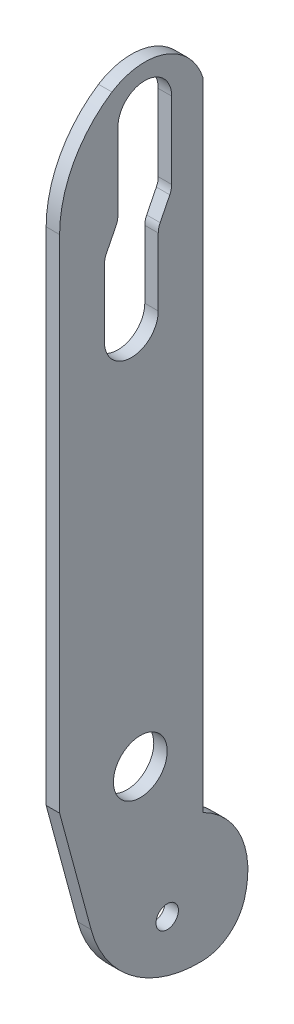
ISO-10303-21;
HEADER;
FILE_DESCRIPTION(('STEP AP214'),'2;1');
FILE_NAME('part.step','',(''),(''),'','','');
FILE_SCHEMA(('AUTOMOTIVE_DESIGN { 1 0 10303 214 1 1 1 1 }'));
ENDSEC;
DATA;
#1=APPLICATION_CONTEXT('core data for automotive mechanical design processes');
#2=APPLICATION_PROTOCOL_DEFINITION('international standard','automotive_design',2000,#1);
#3=PRODUCT_CONTEXT('',#1,'mechanical');
#4=PRODUCT('Part','Part','',(#3));
#5=PRODUCT_RELATED_PRODUCT_CATEGORY('part','',(#4));
#6=PRODUCT_DEFINITION_FORMATION('','',#4);
#7=PRODUCT_DEFINITION_CONTEXT('part definition',#1,'design');
#8=PRODUCT_DEFINITION('design','',#6,#7);
#9=PRODUCT_DEFINITION_SHAPE('','',#8);
#10=(LENGTH_UNIT() NAMED_UNIT(*) SI_UNIT(.MILLI.,.METRE.));
#11=(NAMED_UNIT(*) PLANE_ANGLE_UNIT() SI_UNIT($,.RADIAN.));
#12=(NAMED_UNIT(*) SI_UNIT($,.STERADIAN.) SOLID_ANGLE_UNIT());
#13=UNCERTAINTY_MEASURE_WITH_UNIT(LENGTH_MEASURE(1.E-05),#10,'distance_accuracy_value','');
#14=(GEOMETRIC_REPRESENTATION_CONTEXT(3) GLOBAL_UNCERTAINTY_ASSIGNED_CONTEXT((#13)) GLOBAL_UNIT_ASSIGNED_CONTEXT((#10,
#11,#12)) REPRESENTATION_CONTEXT('',''));
#15=CARTESIAN_POINT('',(0.,0.,0.));
#16=DIRECTION('',(0.,0.,1.));
#17=DIRECTION('',(1.,0.,0.));
#18=AXIS2_PLACEMENT_3D('',#15,#16,#17);
#19=CARTESIAN_POINT('',(0.75,22.0621002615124,-0.138427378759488));
#20=DIRECTION('',(1.,0.,0.));
#21=DIRECTION('',(0.,0.,-1.));
#22=AXIS2_PLACEMENT_3D('',#19,#20,#21);
#23=PLANE('',#22);
#24=CARTESIAN_POINT('',(0.75,-16.,-3.));
#25=DIRECTION('',(1.,0.,0.));
#26=DIRECTION('',(0.,0.,-1.));
#27=AXIS2_PLACEMENT_3D('',#24,#25,#26);
#28=CIRCLE('',#27,1.25);
#29=CARTESIAN_POINT('',(0.75,-16.,-4.25));
#30=VERTEX_POINT('',#29);
#31=EDGE_CURVE('E374',#30,#30,#28,.F.);
#32=ORIENTED_EDGE('',*,*,#31,.T.);
#33=EDGE_LOOP('',(#32));
#34=FACE_BOUND('',#33,.T.);
#35=CARTESIAN_POINT('',(0.75,0.,0.));
#36=DIRECTION('',(1.,0.,0.));
#37=DIRECTION('',(0.,0.,-1.));
#38=AXIS2_PLACEMENT_3D('',#35,#36,#37);
#39=CIRCLE('',#38,3.);
#40=CARTESIAN_POINT('',(0.75,0.,-3.));
#41=VERTEX_POINT('',#40);
#42=EDGE_CURVE('E376',#41,#41,#39,.F.);
#43=ORIENTED_EDGE('',*,*,#42,.T.);
#44=EDGE_LOOP('',(#43));
#45=FACE_BOUND('',#44,.T.);
#46=DIRECTION('',(0.,-0.894427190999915,0.44721359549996));
#47=VECTOR('',#46,1.);
#48=CARTESIAN_POINT('',(0.75,51.,4.00000000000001));
#49=LINE('',#48,#47);
#50=CARTESIAN_POINT('',(0.75,51.4222912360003,3.78885438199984));
#51=VERTEX_POINT('',#50);
#52=CARTESIAN_POINT('',(0.75,53.5777087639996,2.71114561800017));
#53=VERTEX_POINT('',#52);
#54=EDGE_CURVE('E301',#51,#53,#49,.F.);
#55=ORIENTED_EDGE('',*,*,#54,.T.);
#56=CARTESIAN_POINT('',(0.75,54.4721359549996,4.5));
#57=DIRECTION('',(1.,0.,0.));
#58=DIRECTION('',(0.,0.,-1.));
#59=AXIS2_PLACEMENT_3D('',#56,#57,#58);
#60=CIRCLE('',#59,2.);
#61=CARTESIAN_POINT('',(0.75,54.4721359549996,2.5));
#62=VERTEX_POINT('',#61);
#63=EDGE_CURVE('E285',#53,#62,#60,.T.);
#64=ORIENTED_EDGE('',*,*,#63,.T.);
#65=DIRECTION('',(0.,1.,0.));
#66=VECTOR('',#65,1.);
#67=CARTESIAN_POINT('',(0.75,54.,2.5));
#68=LINE('',#67,#66);
#69=CARTESIAN_POINT('',(0.75,63.,2.50000000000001));
#70=VERTEX_POINT('',#69);
#71=EDGE_CURVE('E297',#62,#70,#68,.T.);
#72=ORIENTED_EDGE('',*,*,#71,.T.);
#73=CARTESIAN_POINT('',(0.75,63.,-0.499999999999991));
#74=DIRECTION('',(1.,0.,0.));
#75=DIRECTION('',(0.,0.,-1.));
#76=AXIS2_PLACEMENT_3D('',#73,#74,#75);
#77=CIRCLE('',#76,3.);
#78=CARTESIAN_POINT('',(0.75,63.,-3.49999999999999));
#79=VERTEX_POINT('',#78);
#80=EDGE_CURVE('E324',#70,#79,#77,.F.);
#81=ORIENTED_EDGE('',*,*,#80,.T.);
#82=DIRECTION('',(0.,1.,0.));
#83=VECTOR('',#82,1.);
#84=CARTESIAN_POINT('',(0.75,63.,-3.49999999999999));
#85=LINE('',#84,#83);
#86=CARTESIAN_POINT('',(0.75,54.4721359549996,-3.49999999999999));
#87=VERTEX_POINT('',#86);
#88=EDGE_CURVE('E257',#79,#87,#85,.F.);
#89=ORIENTED_EDGE('',*,*,#88,.T.);
#90=CARTESIAN_POINT('',(0.75,54.4721359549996,-1.49999999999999));
#91=DIRECTION('',(1.,0.,0.));
#92=DIRECTION('',(0.,0.,-1.));
#93=AXIS2_PLACEMENT_3D('',#90,#91,#92);
#94=CIRCLE('',#93,2.);
#95=CARTESIAN_POINT('',(0.75,53.5777087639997,-3.28885438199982));
#96=VERTEX_POINT('',#95);
#97=EDGE_CURVE('E44',#87,#96,#94,.F.);
#98=ORIENTED_EDGE('',*,*,#97,.T.);
#99=DIRECTION('',(0.,0.894427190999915,-0.447213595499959));
#100=VECTOR('',#99,1.);
#101=CARTESIAN_POINT('',(0.75,54.,-3.49999999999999));
#102=LINE('',#101,#100);
#103=CARTESIAN_POINT('',(0.75,51.4222912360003,-2.21114561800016));
#104=VERTEX_POINT('',#103);
#105=EDGE_CURVE('E255',#96,#104,#102,.F.);
#106=ORIENTED_EDGE('',*,*,#105,.T.);
#107=CARTESIAN_POINT('',(0.75,50.5278640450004,-3.99999999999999));
#108=DIRECTION('',(1.,0.,0.));
#109=DIRECTION('',(0.,0.,-1.));
#110=AXIS2_PLACEMENT_3D('',#107,#108,#109);
#111=CIRCLE('',#110,2.);
#112=CARTESIAN_POINT('',(0.75,50.5278640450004,-1.99999999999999));
#113=VERTEX_POINT('',#112);
#114=EDGE_CURVE('E291',#104,#113,#111,.T.);
#115=ORIENTED_EDGE('',*,*,#114,.T.);
#116=DIRECTION('',(0.,1.,0.));
#117=VECTOR('',#116,1.);
#118=CARTESIAN_POINT('',(0.75,51.,-1.99999999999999));
#119=LINE('',#118,#117);
#120=CARTESIAN_POINT('',(0.75,43.,-1.99999999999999));
#121=VERTEX_POINT('',#120);
#122=EDGE_CURVE('E216',#113,#121,#119,.F.);
#123=ORIENTED_EDGE('',*,*,#122,.T.);
#124=CARTESIAN_POINT('',(0.75,43.,1.00000000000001));
#125=DIRECTION('',(1.,0.,0.));
#126=DIRECTION('',(0.,0.,-1.));
#127=AXIS2_PLACEMENT_3D('',#124,#125,#126);
#128=CIRCLE('',#127,3.);
#129=CARTESIAN_POINT('',(0.75,43.,4.00000000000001));
#130=VERTEX_POINT('',#129);
#131=EDGE_CURVE('E219',#121,#130,#128,.F.);
#132=ORIENTED_EDGE('',*,*,#131,.T.);
#133=DIRECTION('',(0.,1.,0.));
#134=VECTOR('',#133,1.);
#135=CARTESIAN_POINT('',(0.75,43.,4.00000000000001));
#136=LINE('',#135,#134);
#137=CARTESIAN_POINT('',(0.75,50.5278640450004,4.00000000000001));
#138=VERTEX_POINT('',#137);
#139=EDGE_CURVE('E314',#130,#138,#136,.T.);
#140=ORIENTED_EDGE('',*,*,#139,.T.);
#141=CARTESIAN_POINT('',(0.75,50.5278640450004,2.00000000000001));
#142=DIRECTION('',(1.,0.,0.));
#143=DIRECTION('',(0.,0.,-1.));
#144=AXIS2_PLACEMENT_3D('',#141,#142,#143);
#145=CIRCLE('',#144,2.);
#146=EDGE_CURVE('E246',#138,#51,#145,.F.);
#147=ORIENTED_EDGE('',*,*,#146,.T.);
#148=EDGE_LOOP('',(#55,#64,#72,#81,#89,#98,#106,#115,#123,#132,#140,#147));
#149=FACE_BOUND('',#148,.T.);
#150=DIRECTION('',(0.,1.,0.));
#151=VECTOR('',#150,1.);
#152=CARTESIAN_POINT('',(0.75,63.,-6.99999999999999));
#153=LINE('',#152,#151);
#154=CARTESIAN_POINT('',(0.75,63.,-6.99999999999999));
#155=VERTEX_POINT('',#154);
#156=CARTESIAN_POINT('',(0.75,-7.93774225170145,-6.99999999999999));
#157=VERTEX_POINT('',#156);
#158=EDGE_CURVE('E361',#155,#157,#153,.F.);
#159=ORIENTED_EDGE('',*,*,#158,.F.);
#160=CARTESIAN_POINT('',(0.75,61.,-0.499999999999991));
#161=DIRECTION('',(1.,0.,0.));
#162=DIRECTION('',(0.,0.,-1.));
#163=AXIS2_PLACEMENT_3D('',#160,#161,#162);
#164=CIRCLE('',#163,6.80073525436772);
#165=CARTESIAN_POINT('',(0.75,66.7306401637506,3.16193436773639));
#166=VERTEX_POINT('',#165);
#167=EDGE_CURVE('E336',#166,#155,#164,.F.);
#168=ORIENTED_EDGE('',*,*,#167,.F.);
#169=CARTESIAN_POINT('',(0.75,55.8813684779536,-3.99999999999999));
#170=DIRECTION('',(1.,0.,0.));
#171=DIRECTION('',(0.,0.,-1.));
#172=AXIS2_PLACEMENT_3D('',#169,#170,#171);
#173=CIRCLE('',#172,13.);
#174=CARTESIAN_POINT('',(0.75,55.8813684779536,9.));
#175=VERTEX_POINT('',#174);
#176=EDGE_CURVE('E332',#175,#166,#173,.F.);
#177=ORIENTED_EDGE('',*,*,#176,.F.);
#178=DIRECTION('',(0.,1.,0.));
#179=VECTOR('',#178,1.);
#180=CARTESIAN_POINT('',(0.75,0.,9.));
#181=LINE('',#180,#179);
#182=CARTESIAN_POINT('',(0.75,0.,9.));
#183=VERTEX_POINT('',#182);
#184=EDGE_CURVE('E621',#183,#175,#181,.T.);
#185=ORIENTED_EDGE('',*,*,#184,.F.);
#186=DIRECTION('',(0.,-0.965340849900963,-0.260992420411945));
#187=VECTOR('',#186,1.);
#188=CARTESIAN_POINT('',(0.75,-13.,5.48528137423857));
#189=LINE('',#188,#187);
#190=CARTESIAN_POINT('',(0.75,-13.,5.48528137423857));
#191=VERTEX_POINT('',#190);
#192=EDGE_CURVE('E179',#191,#183,#189,.F.);
#193=ORIENTED_EDGE('',*,*,#192,.F.);
#194=CARTESIAN_POINT('',(0.75,-9.73759474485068,-6.58147924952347));
#195=DIRECTION('',(1.,0.,0.));
#196=DIRECTION('',(0.,0.,-1.));
#197=AXIS2_PLACEMENT_3D('',#194,#195,#196);
#198=CIRCLE('',#197,12.5);
#199=CARTESIAN_POINT('',(0.75,-22.2320516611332,-6.95369742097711));
#200=VERTEX_POINT('',#199);
#201=EDGE_CURVE('E345',#200,#191,#198,.F.);
#202=ORIENTED_EDGE('',*,*,#201,.F.);
#203=CARTESIAN_POINT('',(0.75,-17.2342688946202,-6.80481015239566));
#204=DIRECTION('',(1.,0.,0.));
#205=DIRECTION('',(0.,0.,-1.));
#206=AXIS2_PLACEMENT_3D('',#203,#204,#205);
#207=CIRCLE('',#206,5.);
#208=CARTESIAN_POINT('',(0.75,-18.7771050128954,-11.5608228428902));
#209=VERTEX_POINT('',#208);
#210=EDGE_CURVE('E343',#209,#200,#207,.F.);
#211=ORIENTED_EDGE('',*,*,#210,.F.);
#212=CARTESIAN_POINT('',(0.75,-16.,-3.));
#213=DIRECTION('',(1.,0.,0.));
#214=DIRECTION('',(0.,0.,-1.));
#215=AXIS2_PLACEMENT_3D('',#212,#213,#214);
#216=CIRCLE('',#215,9.);
#217=EDGE_CURVE('E339',#157,#209,#216,.F.);
#218=ORIENTED_EDGE('',*,*,#217,.F.);
#219=EDGE_LOOP('',(#159,#168,#177,#185,#193,#202,#211,#218));
#220=FACE_BOUND('',#219,.T.);
#221=ADVANCED_FACE('F36',(#34,#45,#149,#220),#23,.T.);
#222=CARTESIAN_POINT('',(0.,-9.73759474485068,-6.58147924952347));
#223=DIRECTION('',(1.,0.,0.));
#224=DIRECTION('',(0.,0.,-1.));
#225=AXIS2_PLACEMENT_3D('',#222,#223,#224);
#226=CYLINDRICAL_SURFACE('',#225,12.5);
#227=CARTESIAN_POINT('',(-0.75,-9.73759474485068,-6.58147924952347));
#228=DIRECTION('',(1.,0.,0.));
#229=DIRECTION('',(0.,0.,-1.));
#230=AXIS2_PLACEMENT_3D('',#227,#228,#229);
#231=CIRCLE('',#230,12.5);
#232=CARTESIAN_POINT('',(-0.75,-13.,5.48528137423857));
#233=VERTEX_POINT('',#232);
#234=CARTESIAN_POINT('',(-0.75,-22.2320516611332,-6.95369742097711));
#235=VERTEX_POINT('',#234);
#236=EDGE_CURVE('E192',#233,#235,#231,.T.);
#237=ORIENTED_EDGE('',*,*,#236,.T.);
#238=DIRECTION('',(1.,0.,0.));
#239=VECTOR('',#238,1.);
#240=CARTESIAN_POINT('',(0.,-22.2320516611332,-6.95369742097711));
#241=LINE('',#240,#239);
#242=EDGE_CURVE('E342',#200,#235,#241,.F.);
#243=ORIENTED_EDGE('',*,*,#242,.F.);
#244=ORIENTED_EDGE('',*,*,#201,.T.);
#245=DIRECTION('',(1.,0.,0.));
#246=VECTOR('',#245,1.);
#247=CARTESIAN_POINT('',(0.,-13.,5.48528137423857));
#248=LINE('',#247,#246);
#249=EDGE_CURVE('E183',#233,#191,#248,.T.);
#250=ORIENTED_EDGE('',*,*,#249,.F.);
#251=EDGE_LOOP('',(#237,#243,#244,#250));
#252=FACE_BOUND('',#251,.T.);
#253=ADVANCED_FACE('F467',(#252),#226,.T.);
#254=CARTESIAN_POINT('',(0.,-17.2342688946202,-6.80481015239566));
#255=DIRECTION('',(1.,0.,0.));
#256=DIRECTION('',(0.,0.,-1.));
#257=AXIS2_PLACEMENT_3D('',#254,#255,#256);
#258=CYLINDRICAL_SURFACE('',#257,5.);
#259=CARTESIAN_POINT('',(-0.75,-17.2342688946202,-6.80481015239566));
#260=DIRECTION('',(1.,0.,0.));
#261=DIRECTION('',(0.,0.,-1.));
#262=AXIS2_PLACEMENT_3D('',#259,#260,#261);
#263=CIRCLE('',#262,5.);
#264=CARTESIAN_POINT('',(-0.75,-18.7771050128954,-11.5608228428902));
#265=VERTEX_POINT('',#264);
#266=EDGE_CURVE('E370',#235,#265,#263,.T.);
#267=ORIENTED_EDGE('',*,*,#266,.T.);
#268=DIRECTION('',(1.,0.,0.));
#269=VECTOR('',#268,1.);
#270=CARTESIAN_POINT('',(0.,-18.7771050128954,-11.5608228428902));
#271=LINE('',#270,#269);
#272=EDGE_CURVE('E341',#209,#265,#271,.F.);
#273=ORIENTED_EDGE('',*,*,#272,.F.);
#274=ORIENTED_EDGE('',*,*,#210,.T.);
#275=ORIENTED_EDGE('',*,*,#242,.T.);
#276=EDGE_LOOP('',(#267,#273,#274,#275));
#277=FACE_BOUND('',#276,.T.);
#278=ADVANCED_FACE('F463',(#277),#258,.T.);
#279=CARTESIAN_POINT('',(0.,-16.,-3.));
#280=DIRECTION('',(1.,0.,0.));
#281=DIRECTION('',(0.,0.,-1.));
#282=AXIS2_PLACEMENT_3D('',#279,#280,#281);
#283=CYLINDRICAL_SURFACE('',#282,9.);
#284=CARTESIAN_POINT('',(-0.75,-16.,-3.));
#285=DIRECTION('',(1.,0.,0.));
#286=DIRECTION('',(0.,0.,-1.));
#287=AXIS2_PLACEMENT_3D('',#284,#285,#286);
#288=CIRCLE('',#287,9.);
#289=CARTESIAN_POINT('',(-0.75,-7.93774225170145,-7.));
#290=VERTEX_POINT('',#289);
#291=EDGE_CURVE('E211',#265,#290,#288,.T.);
#292=ORIENTED_EDGE('',*,*,#291,.T.);
#293=DIRECTION('',(-1.,0.,0.));
#294=VECTOR('',#293,1.);
#295=CARTESIAN_POINT('',(0.,-7.93774225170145,-6.99999999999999));
#296=LINE('',#295,#294);
#297=EDGE_CURVE('E338',#157,#290,#296,.T.);
#298=ORIENTED_EDGE('',*,*,#297,.F.);
#299=ORIENTED_EDGE('',*,*,#217,.T.);
#300=ORIENTED_EDGE('',*,*,#272,.T.);
#301=EDGE_LOOP('',(#292,#298,#299,#300));
#302=FACE_BOUND('',#301,.T.);
#303=ADVANCED_FACE('F459',(#302),#283,.T.);
#304=CARTESIAN_POINT('',(0.,63.,-6.99999999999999));
#305=DIRECTION('',(0.,0.,-1.));
#306=DIRECTION('',(-1.,0.,0.));
#307=AXIS2_PLACEMENT_3D('',#304,#305,#306);
#308=PLANE('',#307);
#309=DIRECTION('',(0.,1.,0.));
#310=VECTOR('',#309,1.);
#311=CARTESIAN_POINT('',(-0.75,22.0621002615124,-7.));
#312=LINE('',#311,#310);
#313=CARTESIAN_POINT('',(-0.75,63.,-7.));
#314=VERTEX_POINT('',#313);
#315=EDGE_CURVE('E208',#290,#314,#312,.T.);
#316=ORIENTED_EDGE('',*,*,#315,.T.);
#317=DIRECTION('',(1.,0.,0.));
#318=VECTOR('',#317,1.);
#319=CARTESIAN_POINT('',(0.,63.,-6.99999999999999));
#320=LINE('',#319,#318);
#321=EDGE_CURVE('E335',#155,#314,#320,.F.);
#322=ORIENTED_EDGE('',*,*,#321,.F.);
#323=ORIENTED_EDGE('',*,*,#158,.T.);
#324=ORIENTED_EDGE('',*,*,#297,.T.);
#325=EDGE_LOOP('',(#316,#322,#323,#324));
#326=FACE_BOUND('',#325,.T.);
#327=ADVANCED_FACE('F455',(#326),#308,.T.);
#328=CARTESIAN_POINT('',(0.,61.,-0.499999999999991));
#329=DIRECTION('',(1.,0.,0.));
#330=DIRECTION('',(0.,0.,-1.));
#331=AXIS2_PLACEMENT_3D('',#328,#329,#330);
#332=CYLINDRICAL_SURFACE('',#331,6.80073525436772);
#333=CARTESIAN_POINT('',(-0.75,61.,-0.499999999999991));
#334=DIRECTION('',(1.,0.,0.));
#335=DIRECTION('',(0.,0.,-1.));
#336=AXIS2_PLACEMENT_3D('',#333,#334,#335);
#337=CIRCLE('',#336,6.80073525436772);
#338=CARTESIAN_POINT('',(-0.75,66.7306401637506,3.16193436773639));
#339=VERTEX_POINT('',#338);
#340=EDGE_CURVE('E201',#314,#339,#337,.T.);
#341=ORIENTED_EDGE('',*,*,#340,.T.);
#342=DIRECTION('',(1.,0.,0.));
#343=VECTOR('',#342,1.);
#344=CARTESIAN_POINT('',(0.,66.7306401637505,3.16193436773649));
#345=LINE('',#344,#343);
#346=EDGE_CURVE('E334',#166,#339,#345,.F.);
#347=ORIENTED_EDGE('',*,*,#346,.F.);
#348=ORIENTED_EDGE('',*,*,#167,.T.);
#349=ORIENTED_EDGE('',*,*,#321,.T.);
#350=EDGE_LOOP('',(#341,#347,#348,#349));
#351=FACE_BOUND('',#350,.T.);
#352=ADVANCED_FACE('F451',(#351),#332,.T.);
#353=CARTESIAN_POINT('',(0.,55.8813684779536,-3.99999999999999));
#354=DIRECTION('',(1.,0.,0.));
#355=DIRECTION('',(0.,0.,-1.));
#356=AXIS2_PLACEMENT_3D('',#353,#354,#355);
#357=CYLINDRICAL_SURFACE('',#356,13.);
#358=CARTESIAN_POINT('',(-0.75,55.8813684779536,-3.99999999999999));
#359=DIRECTION('',(1.,0.,0.));
#360=DIRECTION('',(0.,0.,-1.));
#361=AXIS2_PLACEMENT_3D('',#358,#359,#360);
#362=CIRCLE('',#361,13.);
#363=CARTESIAN_POINT('',(-0.75,55.8813684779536,9.));
#364=VERTEX_POINT('',#363);
#365=EDGE_CURVE('E199',#339,#364,#362,.T.);
#366=ORIENTED_EDGE('',*,*,#365,.T.);
#367=DIRECTION('',(1.,0.,0.));
#368=VECTOR('',#367,1.);
#369=CARTESIAN_POINT('',(0.,55.8813684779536,9.));
#370=LINE('',#369,#368);
#371=EDGE_CURVE('E198',#175,#364,#370,.F.);
#372=ORIENTED_EDGE('',*,*,#371,.F.);
#373=ORIENTED_EDGE('',*,*,#176,.T.);
#374=ORIENTED_EDGE('',*,*,#346,.T.);
#375=EDGE_LOOP('',(#366,#372,#373,#374));
#376=FACE_BOUND('',#375,.T.);
#377=ADVANCED_FACE('F448',(#376),#357,.T.);
#378=CARTESIAN_POINT('',(0.,0.,9.));
#379=DIRECTION('',(0.,0.,1.));
#380=DIRECTION('',(1.,0.,0.));
#381=AXIS2_PLACEMENT_3D('',#378,#379,#380);
#382=PLANE('',#381);
#383=DIRECTION('',(0.,1.,0.));
#384=VECTOR('',#383,1.);
#385=CARTESIAN_POINT('',(-0.75,22.0621002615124,9.));
#386=LINE('',#385,#384);
#387=CARTESIAN_POINT('',(-0.75,0.,9.00000000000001));
#388=VERTEX_POINT('',#387);
#389=EDGE_CURVE('E188',#364,#388,#386,.F.);
#390=ORIENTED_EDGE('',*,*,#389,.T.);
#391=DIRECTION('',(1.,0.,0.));
#392=VECTOR('',#391,1.);
#393=CARTESIAN_POINT('',(0.,0.,9.));
#394=LINE('',#393,#392);
#395=EDGE_CURVE('E173',#183,#388,#394,.F.);
#396=ORIENTED_EDGE('',*,*,#395,.F.);
#397=ORIENTED_EDGE('',*,*,#184,.T.);
#398=ORIENTED_EDGE('',*,*,#371,.T.);
#399=EDGE_LOOP('',(#390,#396,#397,#398));
#400=FACE_BOUND('',#399,.T.);
#401=ADVANCED_FACE('F196',(#400),#382,.T.);
#402=CARTESIAN_POINT('',(0.,-13.,5.48528137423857));
#403=DIRECTION('',(0.,-0.260992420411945,0.965340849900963));
#404=DIRECTION('',(0.,-0.965340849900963,-0.260992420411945));
#405=AXIS2_PLACEMENT_3D('',#402,#403,#404);
#406=PLANE('',#405);
#407=DIRECTION('',(0.,-0.965340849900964,-0.260992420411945));
#408=VECTOR('',#407,1.);
#409=CARTESIAN_POINT('',(-0.75,0.,9.));
#410=LINE('',#409,#408);
#411=EDGE_CURVE('E177',#388,#233,#410,.T.);
#412=ORIENTED_EDGE('',*,*,#411,.T.);
#413=ORIENTED_EDGE('',*,*,#249,.T.);
#414=ORIENTED_EDGE('',*,*,#192,.T.);
#415=ORIENTED_EDGE('',*,*,#395,.T.);
#416=EDGE_LOOP('',(#412,#413,#414,#415));
#417=FACE_BOUND('',#416,.T.);
#418=ADVANCED_FACE('F175',(#417),#406,.T.);
#419=CARTESIAN_POINT('',(0.,43.,4.00000000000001));
#420=DIRECTION('',(0.,0.,1.));
#421=DIRECTION('',(1.,0.,0.));
#422=AXIS2_PLACEMENT_3D('',#419,#420,#421);
#423=PLANE('',#422);
#424=DIRECTION('',(0.,1.,0.));
#425=VECTOR('',#424,1.);
#426=CARTESIAN_POINT('',(-0.75,22.0621002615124,4.00000000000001));
#427=LINE('',#426,#425);
#428=CARTESIAN_POINT('',(-0.75,43.,4.00000000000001));
#429=VERTEX_POINT('',#428);
#430=CARTESIAN_POINT('',(-0.75,50.5278640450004,4.00000000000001));
#431=VERTEX_POINT('',#430);
#432=EDGE_CURVE('E194',#429,#431,#427,.T.);
#433=ORIENTED_EDGE('',*,*,#432,.T.);
#434=DIRECTION('',(1.,0.,0.));
#435=VECTOR('',#434,1.);
#436=CARTESIAN_POINT('',(0.750000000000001,50.5278640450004,4.00000000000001));
#437=LINE('',#436,#435);
#438=EDGE_CURVE('E318',#431,#138,#437,.T.);
#439=ORIENTED_EDGE('',*,*,#438,.T.);
#440=ORIENTED_EDGE('',*,*,#139,.F.);
#441=DIRECTION('',(1.,0.,0.));
#442=VECTOR('',#441,1.);
#443=CARTESIAN_POINT('',(0.,43.,4.00000000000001));
#444=LINE('',#443,#442);
#445=EDGE_CURVE('E212',#130,#429,#444,.F.);
#446=ORIENTED_EDGE('',*,*,#445,.T.);
#447=EDGE_LOOP('',(#433,#439,#440,#446));
#448=FACE_BOUND('',#447,.T.);
#449=ADVANCED_FACE('F440',(#448),#423,.F.);
#450=CARTESIAN_POINT('',(0.,51.,4.00000000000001));
#451=DIRECTION('',(0.,0.44721359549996,0.894427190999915));
#452=DIRECTION('',(0.,-0.894427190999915,0.44721359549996));
#453=AXIS2_PLACEMENT_3D('',#450,#451,#452);
#454=PLANE('',#453);
#455=ORIENTED_EDGE('',*,*,#54,.F.);
#456=DIRECTION('',(1.,0.,0.));
#457=VECTOR('',#456,1.);
#458=CARTESIAN_POINT('',(-0.75,51.4222912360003,3.78885438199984));
#459=LINE('',#458,#457);
#460=CARTESIAN_POINT('',(-0.75,51.4222912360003,3.78885438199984));
#461=VERTEX_POINT('',#460);
#462=EDGE_CURVE('E292',#51,#461,#459,.F.);
#463=ORIENTED_EDGE('',*,*,#462,.T.);
#464=DIRECTION('',(0.,0.894427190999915,-0.44721359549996));
#465=VECTOR('',#464,1.);
#466=CARTESIAN_POINT('',(-0.75,51.,4.00000000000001));
#467=LINE('',#466,#465);
#468=CARTESIAN_POINT('',(-0.75,53.5777087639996,2.71114561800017));
#469=VERTEX_POINT('',#468);
#470=EDGE_CURVE('E284',#461,#469,#467,.T.);
#471=ORIENTED_EDGE('',*,*,#470,.T.);
#472=DIRECTION('',(1.,0.,0.));
#473=VECTOR('',#472,1.);
#474=CARTESIAN_POINT('',(0.,53.5777087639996,2.71114561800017));
#475=LINE('',#474,#473);
#476=EDGE_CURVE('E294',#469,#53,#475,.T.);
#477=ORIENTED_EDGE('',*,*,#476,.T.);
#478=EDGE_LOOP('',(#455,#463,#471,#477));
#479=FACE_BOUND('',#478,.T.);
#480=ADVANCED_FACE('F437',(#479),#454,.F.);
#481=CARTESIAN_POINT('',(0.,54.,2.5));
#482=DIRECTION('',(0.,0.,1.));
#483=DIRECTION('',(1.,0.,0.));
#484=AXIS2_PLACEMENT_3D('',#481,#482,#483);
#485=PLANE('',#484);
#486=ORIENTED_EDGE('',*,*,#71,.F.);
#487=DIRECTION('',(1.,0.,0.));
#488=VECTOR('',#487,1.);
#489=CARTESIAN_POINT('',(0.,54.4721359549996,2.5));
#490=LINE('',#489,#488);
#491=CARTESIAN_POINT('',(-0.75,54.4721359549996,2.5));
#492=VERTEX_POINT('',#491);
#493=EDGE_CURVE('E234',#62,#492,#490,.F.);
#494=ORIENTED_EDGE('',*,*,#493,.T.);
#495=DIRECTION('',(0.,1.,0.));
#496=VECTOR('',#495,1.);
#497=CARTESIAN_POINT('',(-0.75,22.0621002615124,2.5));
#498=LINE('',#497,#496);
#499=CARTESIAN_POINT('',(-0.75,63.,2.50000000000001));
#500=VERTEX_POINT('',#499);
#501=EDGE_CURVE('E273',#492,#500,#498,.T.);
#502=ORIENTED_EDGE('',*,*,#501,.T.);
#503=DIRECTION('',(1.,0.,0.));
#504=VECTOR('',#503,1.);
#505=CARTESIAN_POINT('',(0.,63.,2.50000000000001));
#506=LINE('',#505,#504);
#507=EDGE_CURVE('E300',#500,#70,#506,.T.);
#508=ORIENTED_EDGE('',*,*,#507,.T.);
#509=EDGE_LOOP('',(#486,#494,#502,#508));
#510=FACE_BOUND('',#509,.T.);
#511=ADVANCED_FACE('F434',(#510),#485,.F.);
#512=CARTESIAN_POINT('',(0.,63.,-0.499999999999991));
#513=DIRECTION('',(1.,0.,0.));
#514=DIRECTION('',(0.,0.,-1.));
#515=AXIS2_PLACEMENT_3D('',#512,#513,#514);
#516=CYLINDRICAL_SURFACE('',#515,3.);
#517=ORIENTED_EDGE('',*,*,#507,.F.);
#518=CARTESIAN_POINT('',(-0.75,63.,-0.499999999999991));
#519=DIRECTION('',(1.,0.,0.));
#520=DIRECTION('',(0.,0.,-1.));
#521=AXIS2_PLACEMENT_3D('',#518,#519,#520);
#522=CIRCLE('',#521,3.);
#523=CARTESIAN_POINT('',(-0.75,63.,-3.49999999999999));
#524=VERTEX_POINT('',#523);
#525=EDGE_CURVE('E271',#500,#524,#522,.F.);
#526=ORIENTED_EDGE('',*,*,#525,.T.);
#527=DIRECTION('',(-1.,0.,0.));
#528=VECTOR('',#527,1.);
#529=CARTESIAN_POINT('',(0.,63.,-3.49999999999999));
#530=LINE('',#529,#528);
#531=EDGE_CURVE('E222',#524,#79,#530,.F.);
#532=ORIENTED_EDGE('',*,*,#531,.T.);
#533=ORIENTED_EDGE('',*,*,#80,.F.);
#534=EDGE_LOOP('',(#517,#526,#532,#533));
#535=FACE_BOUND('',#534,.T.);
#536=ADVANCED_FACE('F431',(#535),#516,.F.);
#537=CARTESIAN_POINT('',(0.,63.,-3.49999999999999));
#538=DIRECTION('',(0.,0.,-1.));
#539=DIRECTION('',(-1.,0.,0.));
#540=AXIS2_PLACEMENT_3D('',#537,#538,#539);
#541=PLANE('',#540);
#542=DIRECTION('',(0.,1.,0.));
#543=VECTOR('',#542,1.);
#544=CARTESIAN_POINT('',(-0.75,22.0621002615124,-3.49999999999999));
#545=LINE('',#544,#543);
#546=CARTESIAN_POINT('',(-0.75,54.4721359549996,-3.49999999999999));
#547=VERTEX_POINT('',#546);
#548=EDGE_CURVE('E229',#524,#547,#545,.F.);
#549=ORIENTED_EDGE('',*,*,#548,.T.);
#550=DIRECTION('',(1.,0.,0.));
#551=VECTOR('',#550,1.);
#552=CARTESIAN_POINT('',(0.75,54.4721359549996,-3.49999999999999));
#553=LINE('',#552,#551);
#554=EDGE_CURVE('E243',#547,#87,#553,.T.);
#555=ORIENTED_EDGE('',*,*,#554,.T.);
#556=ORIENTED_EDGE('',*,*,#88,.F.);
#557=ORIENTED_EDGE('',*,*,#531,.F.);
#558=EDGE_LOOP('',(#549,#555,#556,#557));
#559=FACE_BOUND('',#558,.T.);
#560=ADVANCED_FACE('F267',(#559),#541,.F.);
#561=CARTESIAN_POINT('',(0.,54.,-3.49999999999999));
#562=DIRECTION('',(0.,-0.447213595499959,-0.894427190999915));
#563=DIRECTION('',(0.,0.894427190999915,-0.447213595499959));
#564=AXIS2_PLACEMENT_3D('',#561,#562,#563);
#565=PLANE('',#564);
#566=DIRECTION('',(0.,-0.894427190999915,0.44721359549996));
#567=VECTOR('',#566,1.);
#568=CARTESIAN_POINT('',(-0.75,54.,-3.49999999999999));
#569=LINE('',#568,#567);
#570=CARTESIAN_POINT('',(-0.75,53.5777087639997,-3.28885438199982));
#571=VERTEX_POINT('',#570);
#572=CARTESIAN_POINT('',(-0.75,51.4222912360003,-2.21114561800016));
#573=VERTEX_POINT('',#572);
#574=EDGE_CURVE('E225',#571,#573,#569,.T.);
#575=ORIENTED_EDGE('',*,*,#574,.T.);
#576=DIRECTION('',(1.,0.,0.));
#577=VECTOR('',#576,1.);
#578=CARTESIAN_POINT('',(0.,51.4222912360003,-2.21114561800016));
#579=LINE('',#578,#577);
#580=EDGE_CURVE('E238',#573,#104,#579,.T.);
#581=ORIENTED_EDGE('',*,*,#580,.T.);
#582=ORIENTED_EDGE('',*,*,#105,.F.);
#583=DIRECTION('',(1.,0.,0.));
#584=VECTOR('',#583,1.);
#585=CARTESIAN_POINT('',(-0.75,53.5777087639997,-3.28885438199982));
#586=LINE('',#585,#584);
#587=EDGE_CURVE('E236',#96,#571,#586,.F.);
#588=ORIENTED_EDGE('',*,*,#587,.T.);
#589=EDGE_LOOP('',(#575,#581,#582,#588));
#590=FACE_BOUND('',#589,.T.);
#591=ADVANCED_FACE('F262',(#590),#565,.F.);
#592=CARTESIAN_POINT('',(0.,51.,-1.99999999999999));
#593=DIRECTION('',(0.,0.,-1.));
#594=DIRECTION('',(-1.,0.,0.));
#595=AXIS2_PLACEMENT_3D('',#592,#593,#594);
#596=PLANE('',#595);
#597=ORIENTED_EDGE('',*,*,#122,.F.);
#598=DIRECTION('',(1.,0.,0.));
#599=VECTOR('',#598,1.);
#600=CARTESIAN_POINT('',(0.,50.5278640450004,-1.99999999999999));
#601=LINE('',#600,#599);
#602=CARTESIAN_POINT('',(-0.75,50.5278640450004,-1.99999999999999));
#603=VERTEX_POINT('',#602);
#604=EDGE_CURVE('E241',#113,#603,#601,.F.);
#605=ORIENTED_EDGE('',*,*,#604,.T.);
#606=DIRECTION('',(0.,1.,0.));
#607=VECTOR('',#606,1.);
#608=CARTESIAN_POINT('',(-0.75,22.0621002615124,-1.99999999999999));
#609=LINE('',#608,#607);
#610=CARTESIAN_POINT('',(-0.75,43.,-1.99999999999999));
#611=VERTEX_POINT('',#610);
#612=EDGE_CURVE('E228',#603,#611,#609,.F.);
#613=ORIENTED_EDGE('',*,*,#612,.T.);
#614=DIRECTION('',(1.,0.,0.));
#615=VECTOR('',#614,1.);
#616=CARTESIAN_POINT('',(0.,43.,-1.99999999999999));
#617=LINE('',#616,#615);
#618=EDGE_CURVE('E215',#611,#121,#617,.T.);
#619=ORIENTED_EDGE('',*,*,#618,.T.);
#620=EDGE_LOOP('',(#597,#605,#613,#619));
#621=FACE_BOUND('',#620,.T.);
#622=ADVANCED_FACE('F388',(#621),#596,.F.);
#623=CARTESIAN_POINT('',(0.,43.,1.00000000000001));
#624=DIRECTION('',(1.,0.,0.));
#625=DIRECTION('',(0.,0.,-1.));
#626=AXIS2_PLACEMENT_3D('',#623,#624,#625);
#627=CYLINDRICAL_SURFACE('',#626,3.);
#628=ORIENTED_EDGE('',*,*,#618,.F.);
#629=CARTESIAN_POINT('',(-0.75,43.,1.00000000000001));
#630=DIRECTION('',(1.,0.,0.));
#631=DIRECTION('',(0.,0.,-1.));
#632=AXIS2_PLACEMENT_3D('',#629,#630,#631);
#633=CIRCLE('',#632,3.);
#634=EDGE_CURVE('E358',#611,#429,#633,.F.);
#635=ORIENTED_EDGE('',*,*,#634,.T.);
#636=ORIENTED_EDGE('',*,*,#445,.F.);
#637=ORIENTED_EDGE('',*,*,#131,.F.);
#638=EDGE_LOOP('',(#628,#635,#636,#637));
#639=FACE_BOUND('',#638,.T.);
#640=ADVANCED_FACE('F385',(#639),#627,.F.);
#641=CARTESIAN_POINT('',(0.,0.,0.));
#642=DIRECTION('',(1.,0.,0.));
#643=DIRECTION('',(0.,0.,-1.));
#644=AXIS2_PLACEMENT_3D('',#641,#642,#643);
#645=CYLINDRICAL_SURFACE('',#644,3.);
#646=ORIENTED_EDGE('',*,*,#42,.F.);
#647=EDGE_LOOP('',(#646));
#648=FACE_BOUND('',#647,.T.);
#649=CARTESIAN_POINT('',(-0.75,0.,0.));
#650=DIRECTION('',(1.,0.,0.));
#651=DIRECTION('',(0.,0.,-1.));
#652=AXIS2_PLACEMENT_3D('',#649,#650,#651);
#653=CIRCLE('',#652,3.);
#654=CARTESIAN_POINT('',(-0.75,0.,-3.));
#655=VERTEX_POINT('',#654);
#656=EDGE_CURVE('E353',#655,#655,#653,.F.);
#657=ORIENTED_EDGE('',*,*,#656,.T.);
#658=EDGE_LOOP('',(#657));
#659=FACE_BOUND('',#658,.T.);
#660=ADVANCED_FACE('F412',(#648,#659),#645,.F.);
#661=CARTESIAN_POINT('',(0.,-16.,-3.));
#662=DIRECTION('',(1.,0.,0.));
#663=DIRECTION('',(0.,0.,-1.));
#664=AXIS2_PLACEMENT_3D('',#661,#662,#663);
#665=CYLINDRICAL_SURFACE('',#664,1.25);
#666=ORIENTED_EDGE('',*,*,#31,.F.);
#667=EDGE_LOOP('',(#666));
#668=FACE_BOUND('',#667,.T.);
#669=CARTESIAN_POINT('',(-0.75,-16.,-3.));
#670=DIRECTION('',(1.,0.,0.));
#671=DIRECTION('',(0.,0.,-1.));
#672=AXIS2_PLACEMENT_3D('',#669,#670,#671);
#673=CIRCLE('',#672,1.25);
#674=CARTESIAN_POINT('',(-0.75,-16.,-4.25));
#675=VERTEX_POINT('',#674);
#676=EDGE_CURVE('E347',#675,#675,#673,.F.);
#677=ORIENTED_EDGE('',*,*,#676,.T.);
#678=EDGE_LOOP('',(#677));
#679=FACE_BOUND('',#678,.T.);
#680=ADVANCED_FACE('F404',(#668,#679),#665,.F.);
#681=CARTESIAN_POINT('',(-0.75,22.0621002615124,-0.138427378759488));
#682=DIRECTION('',(1.,0.,0.));
#683=DIRECTION('',(0.,0.,-1.));
#684=AXIS2_PLACEMENT_3D('',#681,#682,#683);
#685=PLANE('',#684);
#686=ORIENTED_EDGE('',*,*,#676,.F.);
#687=EDGE_LOOP('',(#686));
#688=FACE_BOUND('',#687,.T.);
#689=ORIENTED_EDGE('',*,*,#656,.F.);
#690=EDGE_LOOP('',(#689));
#691=FACE_BOUND('',#690,.T.);
#692=ORIENTED_EDGE('',*,*,#501,.F.);
#693=CARTESIAN_POINT('',(-0.75,54.4721359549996,4.5));
#694=DIRECTION('',(1.,0.,0.));
#695=DIRECTION('',(0.,0.,-1.));
#696=AXIS2_PLACEMENT_3D('',#693,#694,#695);
#697=CIRCLE('',#696,2.);
#698=EDGE_CURVE('E233',#492,#469,#697,.F.);
#699=ORIENTED_EDGE('',*,*,#698,.T.);
#700=ORIENTED_EDGE('',*,*,#470,.F.);
#701=CARTESIAN_POINT('',(-0.75,50.5278640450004,2.00000000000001));
#702=DIRECTION('',(1.,0.,0.));
#703=DIRECTION('',(0.,0.,-1.));
#704=AXIS2_PLACEMENT_3D('',#701,#702,#703);
#705=CIRCLE('',#704,2.);
#706=EDGE_CURVE('E248',#461,#431,#705,.T.);
#707=ORIENTED_EDGE('',*,*,#706,.T.);
#708=ORIENTED_EDGE('',*,*,#432,.F.);
#709=ORIENTED_EDGE('',*,*,#634,.F.);
#710=ORIENTED_EDGE('',*,*,#612,.F.);
#711=CARTESIAN_POINT('',(-0.75,50.5278640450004,-3.99999999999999));
#712=DIRECTION('',(1.,0.,0.));
#713=DIRECTION('',(0.,0.,-1.));
#714=AXIS2_PLACEMENT_3D('',#711,#712,#713);
#715=CIRCLE('',#714,2.);
#716=EDGE_CURVE('E55',#603,#573,#715,.F.);
#717=ORIENTED_EDGE('',*,*,#716,.T.);
#718=ORIENTED_EDGE('',*,*,#574,.F.);
#719=CARTESIAN_POINT('',(-0.75,54.4721359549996,-1.49999999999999));
#720=DIRECTION('',(1.,0.,0.));
#721=DIRECTION('',(0.,0.,-1.));
#722=AXIS2_PLACEMENT_3D('',#719,#720,#721);
#723=CIRCLE('',#722,2.);
#724=EDGE_CURVE('E11',#571,#547,#723,.T.);
#725=ORIENTED_EDGE('',*,*,#724,.T.);
#726=ORIENTED_EDGE('',*,*,#548,.F.);
#727=ORIENTED_EDGE('',*,*,#525,.F.);
#728=EDGE_LOOP('',(#692,#699,#700,#707,#708,#709,#710,#717,#718,#725,#726,#727));
#729=FACE_BOUND('',#728,.T.);
#730=ORIENTED_EDGE('',*,*,#389,.F.);
#731=ORIENTED_EDGE('',*,*,#365,.F.);
#732=ORIENTED_EDGE('',*,*,#340,.F.);
#733=ORIENTED_EDGE('',*,*,#315,.F.);
#734=ORIENTED_EDGE('',*,*,#291,.F.);
#735=ORIENTED_EDGE('',*,*,#266,.F.);
#736=ORIENTED_EDGE('',*,*,#236,.F.);
#737=ORIENTED_EDGE('',*,*,#411,.F.);
#738=EDGE_LOOP('',(#730,#731,#732,#733,#734,#735,#736,#737));
#739=FACE_BOUND('',#738,.T.);
#740=ADVANCED_FACE('F38',(#688,#691,#729,#739),#685,.F.);
#741=CARTESIAN_POINT('',(0.,50.5278640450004,2.00000000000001));
#742=DIRECTION('',(-1.,0.,0.));
#743=DIRECTION('',(0.,0.,1.));
#744=AXIS2_PLACEMENT_3D('',#741,#742,#743);
#745=CYLINDRICAL_SURFACE('',#744,2.);
#746=ORIENTED_EDGE('',*,*,#706,.F.);
#747=ORIENTED_EDGE('',*,*,#462,.F.);
#748=ORIENTED_EDGE('',*,*,#146,.F.);
#749=ORIENTED_EDGE('',*,*,#438,.F.);
#750=EDGE_LOOP('',(#746,#747,#748,#749));
#751=FACE_BOUND('',#750,.T.);
#752=ADVANCED_FACE('F400',(#751),#745,.F.);
#753=CARTESIAN_POINT('',(0.,54.4721359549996,4.5));
#754=DIRECTION('',(1.,0.,0.));
#755=DIRECTION('',(0.,0.,-1.));
#756=AXIS2_PLACEMENT_3D('',#753,#754,#755);
#757=CYLINDRICAL_SURFACE('',#756,2.);
#758=ORIENTED_EDGE('',*,*,#698,.F.);
#759=ORIENTED_EDGE('',*,*,#493,.F.);
#760=ORIENTED_EDGE('',*,*,#63,.F.);
#761=ORIENTED_EDGE('',*,*,#476,.F.);
#762=EDGE_LOOP('',(#758,#759,#760,#761));
#763=FACE_BOUND('',#762,.T.);
#764=ADVANCED_FACE('F393',(#763),#757,.T.);
#765=CARTESIAN_POINT('',(0.,50.5278640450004,-3.99999999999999));
#766=DIRECTION('',(1.,0.,0.));
#767=DIRECTION('',(0.,0.,-1.));
#768=AXIS2_PLACEMENT_3D('',#765,#766,#767);
#769=CYLINDRICAL_SURFACE('',#768,2.);
#770=ORIENTED_EDGE('',*,*,#716,.F.);
#771=ORIENTED_EDGE('',*,*,#604,.F.);
#772=ORIENTED_EDGE('',*,*,#114,.F.);
#773=ORIENTED_EDGE('',*,*,#580,.F.);
#774=EDGE_LOOP('',(#770,#771,#772,#773));
#775=FACE_BOUND('',#774,.T.);
#776=ADVANCED_FACE('F391',(#775),#769,.T.);
#777=CARTESIAN_POINT('',(0.,54.4721359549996,-1.49999999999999));
#778=DIRECTION('',(-1.,0.,0.));
#779=DIRECTION('',(0.,0.,1.));
#780=AXIS2_PLACEMENT_3D('',#777,#778,#779);
#781=CYLINDRICAL_SURFACE('',#780,2.);
#782=ORIENTED_EDGE('',*,*,#724,.F.);
#783=ORIENTED_EDGE('',*,*,#587,.F.);
#784=ORIENTED_EDGE('',*,*,#97,.F.);
#785=ORIENTED_EDGE('',*,*,#554,.F.);
#786=EDGE_LOOP('',(#782,#783,#784,#785));
#787=FACE_BOUND('',#786,.T.);
#788=ADVANCED_FACE('F265',(#787),#781,.F.);
#789=CLOSED_SHELL('',(#221,#253,#278,#303,#327,#352,#377,#401,#418,#449,#480,#511,#536,#560,
#591,#622,#640,#660,#680,#740,#752,#764,#776,#788));
#790=MANIFOLD_SOLID_BREP('B2',#789);
#791=ADVANCED_BREP_SHAPE_REPRESENTATION('',(#18,#790),#14);
#792=SHAPE_DEFINITION_REPRESENTATION(#9,#791);
ENDSEC;
END-ISO-10303-21;
